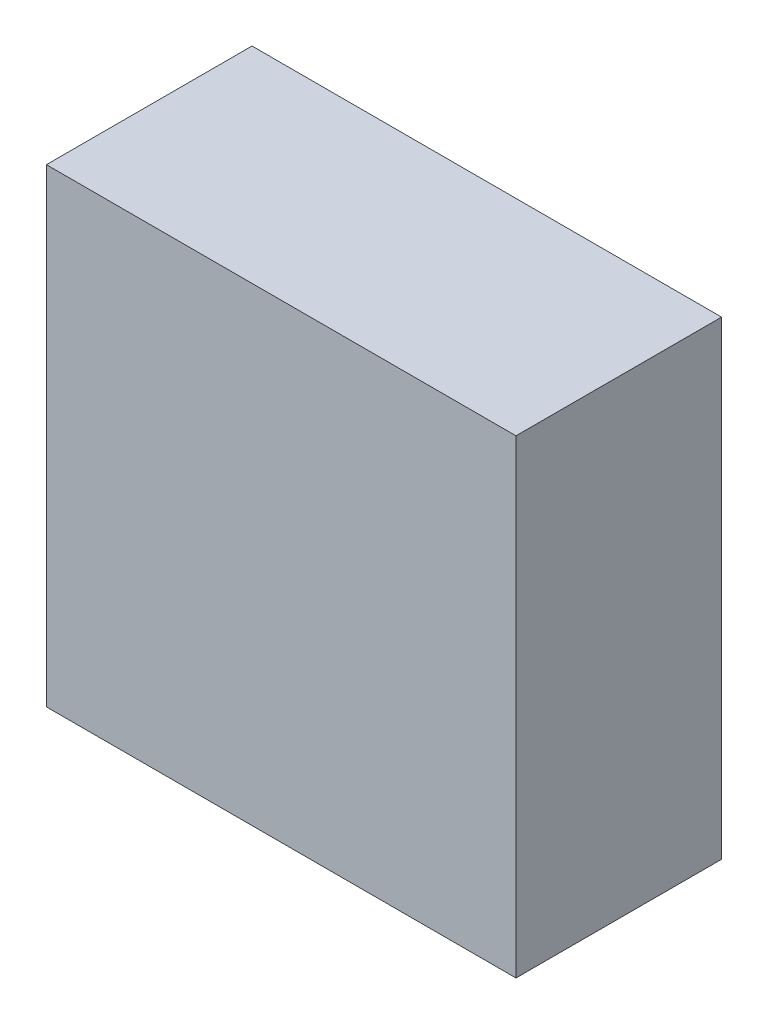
ISO-10303-21;
HEADER;
FILE_DESCRIPTION(('STEP AP214'),'2;1');
FILE_NAME('part.step','',(''),(''),'','','');
FILE_SCHEMA(('AUTOMOTIVE_DESIGN { 1 0 10303 214 1 1 1 1 }'));
ENDSEC;
DATA;
#1=APPLICATION_CONTEXT('core data for automotive mechanical design processes');
#2=APPLICATION_PROTOCOL_DEFINITION('international standard','automotive_design',2000,#1);
#3=PRODUCT_CONTEXT('',#1,'mechanical');
#4=PRODUCT('Part','Part','',(#3));
#5=PRODUCT_RELATED_PRODUCT_CATEGORY('part','',(#4));
#6=PRODUCT_DEFINITION_FORMATION('','',#4);
#7=PRODUCT_DEFINITION_CONTEXT('part definition',#1,'design');
#8=PRODUCT_DEFINITION('design','',#6,#7);
#9=PRODUCT_DEFINITION_SHAPE('','',#8);
#10=(LENGTH_UNIT() NAMED_UNIT(*) SI_UNIT(.MILLI.,.METRE.));
#11=(NAMED_UNIT(*) PLANE_ANGLE_UNIT() SI_UNIT($,.RADIAN.));
#12=(NAMED_UNIT(*) SI_UNIT($,.STERADIAN.) SOLID_ANGLE_UNIT());
#13=UNCERTAINTY_MEASURE_WITH_UNIT(LENGTH_MEASURE(1.E-05),#10,'distance_accuracy_value','');
#14=(GEOMETRIC_REPRESENTATION_CONTEXT(3) GLOBAL_UNCERTAINTY_ASSIGNED_CONTEXT((#13)) GLOBAL_UNIT_ASSIGNED_CONTEXT((#10,
#11,#12)) REPRESENTATION_CONTEXT('',''));
#15=CARTESIAN_POINT('',(0.,0.,0.));
#16=DIRECTION('',(0.,0.,1.));
#17=DIRECTION('',(1.,0.,0.));
#18=AXIS2_PLACEMENT_3D('',#15,#16,#17);
#19=CARTESIAN_POINT('',(0.,0.,13.9));
#20=DIRECTION('',(0.,0.,-1.));
#21=DIRECTION('',(-1.,0.,0.));
#22=AXIS2_PLACEMENT_3D('',#19,#20,#21);
#23=PLANE('',#22);
#24=DIRECTION('',(1.,0.,0.));
#25=VECTOR('',#24,1.);
#26=CARTESIAN_POINT('',(-15.875,15.875,13.9));
#27=LINE('',#26,#25);
#28=CARTESIAN_POINT('',(-15.875,15.875,13.9));
#29=VERTEX_POINT('',#28);
#30=CARTESIAN_POINT('',(15.875,15.875,13.9));
#31=VERTEX_POINT('',#30);
#32=EDGE_CURVE('E68',#29,#31,#27,.T.);
#33=ORIENTED_EDGE('',*,*,#32,.F.);
#34=DIRECTION('',(0.,1.,0.));
#35=VECTOR('',#34,1.);
#36=CARTESIAN_POINT('',(-15.875,-15.875,13.9));
#37=LINE('',#36,#35);
#38=CARTESIAN_POINT('',(-15.875,-15.875,13.9));
#39=VERTEX_POINT('',#38);
#40=EDGE_CURVE('E76',#39,#29,#37,.T.);
#41=ORIENTED_EDGE('',*,*,#40,.F.);
#42=DIRECTION('',(-1.,0.,0.));
#43=VECTOR('',#42,1.);
#44=CARTESIAN_POINT('',(15.875,-15.875,13.9));
#45=LINE('',#44,#43);
#46=CARTESIAN_POINT('',(15.875,-15.875,13.9));
#47=VERTEX_POINT('',#46);
#48=EDGE_CURVE('E70',#47,#39,#45,.T.);
#49=ORIENTED_EDGE('',*,*,#48,.F.);
#50=DIRECTION('',(0.,-1.,0.));
#51=VECTOR('',#50,1.);
#52=CARTESIAN_POINT('',(15.875,15.875,13.9));
#53=LINE('',#52,#51);
#54=EDGE_CURVE('E56',#31,#47,#53,.T.);
#55=ORIENTED_EDGE('',*,*,#54,.F.);
#56=EDGE_LOOP('',(#33,#41,#49,#55));
#57=FACE_BOUND('',#56,.T.);
#58=ADVANCED_FACE('F14',(#57),#23,.F.);
#59=CARTESIAN_POINT('',(-15.875,15.875,0.254));
#60=DIRECTION('',(0.,1.,0.));
#61=DIRECTION('',(-1.,0.,0.));
#62=AXIS2_PLACEMENT_3D('',#59,#60,#61);
#63=PLANE('',#62);
#64=DIRECTION('',(0.,0.,1.));
#65=VECTOR('',#64,1.);
#66=CARTESIAN_POINT('',(-15.875,15.875,0.254));
#67=LINE('',#66,#65);
#68=CARTESIAN_POINT('',(-15.875,15.875,0.));
#69=VERTEX_POINT('',#68);
#70=EDGE_CURVE('E62',#69,#29,#67,.T.);
#71=ORIENTED_EDGE('',*,*,#70,.T.);
#72=ORIENTED_EDGE('',*,*,#32,.T.);
#73=DIRECTION('',(0.,0.,1.));
#74=VECTOR('',#73,1.);
#75=CARTESIAN_POINT('',(15.875,15.875,0.254));
#76=LINE('',#75,#74);
#77=CARTESIAN_POINT('',(15.875,15.875,0.));
#78=VERTEX_POINT('',#77);
#79=EDGE_CURVE('E53',#78,#31,#76,.T.);
#80=ORIENTED_EDGE('',*,*,#79,.F.);
#81=DIRECTION('',(-1.,0.,0.));
#82=VECTOR('',#81,1.);
#83=CARTESIAN_POINT('',(-15.875,15.875,0.));
#84=LINE('',#83,#82);
#85=EDGE_CURVE('E81',#78,#69,#84,.T.);
#86=ORIENTED_EDGE('',*,*,#85,.T.);
#87=EDGE_LOOP('',(#71,#72,#80,#86));
#88=FACE_BOUND('',#87,.T.);
#89=ADVANCED_FACE('F72',(#88),#63,.T.);
#90=CARTESIAN_POINT('',(15.875,15.875,0.254));
#91=DIRECTION('',(1.,0.,0.));
#92=DIRECTION('',(0.,1.,0.));
#93=AXIS2_PLACEMENT_3D('',#90,#91,#92);
#94=PLANE('',#93);
#95=ORIENTED_EDGE('',*,*,#54,.T.);
#96=DIRECTION('',(0.,0.,1.));
#97=VECTOR('',#96,1.);
#98=CARTESIAN_POINT('',(15.875,-15.875,0.254));
#99=LINE('',#98,#97);
#100=CARTESIAN_POINT('',(15.875,-15.875,0.));
#101=VERTEX_POINT('',#100);
#102=EDGE_CURVE('E9',#101,#47,#99,.T.);
#103=ORIENTED_EDGE('',*,*,#102,.F.);
#104=DIRECTION('',(0.,1.,0.));
#105=VECTOR('',#104,1.);
#106=CARTESIAN_POINT('',(15.875,15.875,0.));
#107=LINE('',#106,#105);
#108=EDGE_CURVE('E57',#101,#78,#107,.T.);
#109=ORIENTED_EDGE('',*,*,#108,.T.);
#110=ORIENTED_EDGE('',*,*,#79,.T.);
#111=EDGE_LOOP('',(#95,#103,#109,#110));
#112=FACE_BOUND('',#111,.T.);
#113=ADVANCED_FACE('F55',(#112),#94,.T.);
#114=CARTESIAN_POINT('',(-15.875,15.875,0.254));
#115=DIRECTION('',(-1.,0.,0.));
#116=DIRECTION('',(0.,-1.,0.));
#117=AXIS2_PLACEMENT_3D('',#114,#115,#116);
#118=PLANE('',#117);
#119=ORIENTED_EDGE('',*,*,#40,.T.);
#120=ORIENTED_EDGE('',*,*,#70,.F.);
#121=DIRECTION('',(0.,-1.,0.));
#122=VECTOR('',#121,1.);
#123=CARTESIAN_POINT('',(-15.875,15.875,0.));
#124=LINE('',#123,#122);
#125=CARTESIAN_POINT('',(-15.875,-15.875,0.));
#126=VERTEX_POINT('',#125);
#127=EDGE_CURVE('E82',#69,#126,#124,.T.);
#128=ORIENTED_EDGE('',*,*,#127,.T.);
#129=DIRECTION('',(0.,0.,1.));
#130=VECTOR('',#129,1.);
#131=CARTESIAN_POINT('',(-15.875,-15.875,0.254));
#132=LINE('',#131,#130);
#133=EDGE_CURVE('E23',#126,#39,#132,.T.);
#134=ORIENTED_EDGE('',*,*,#133,.T.);
#135=EDGE_LOOP('',(#119,#120,#128,#134));
#136=FACE_BOUND('',#135,.T.);
#137=ADVANCED_FACE('F93',(#136),#118,.T.);
#138=CARTESIAN_POINT('',(-15.875,-15.875,0.254));
#139=DIRECTION('',(0.,-1.,0.));
#140=DIRECTION('',(1.,0.,0.));
#141=AXIS2_PLACEMENT_3D('',#138,#139,#140);
#142=PLANE('',#141);
#143=ORIENTED_EDGE('',*,*,#102,.T.);
#144=ORIENTED_EDGE('',*,*,#48,.T.);
#145=ORIENTED_EDGE('',*,*,#133,.F.);
#146=DIRECTION('',(1.,0.,0.));
#147=VECTOR('',#146,1.);
#148=CARTESIAN_POINT('',(-15.875,-15.875,0.));
#149=LINE('',#148,#147);
#150=EDGE_CURVE('E18',#126,#101,#149,.T.);
#151=ORIENTED_EDGE('',*,*,#150,.T.);
#152=EDGE_LOOP('',(#143,#144,#145,#151));
#153=FACE_BOUND('',#152,.T.);
#154=ADVANCED_FACE('F86',(#153),#142,.T.);
#155=CARTESIAN_POINT('',(0.,0.,0.));
#156=DIRECTION('',(0.,0.,1.));
#157=DIRECTION('',(0.,-1.,0.));
#158=AXIS2_PLACEMENT_3D('',#155,#156,#157);
#159=PLANE('',#158);
#160=ORIENTED_EDGE('',*,*,#108,.F.);
#161=ORIENTED_EDGE('',*,*,#150,.F.);
#162=ORIENTED_EDGE('',*,*,#127,.F.);
#163=ORIENTED_EDGE('',*,*,#85,.F.);
#164=EDGE_LOOP('',(#160,#161,#162,#163));
#165=FACE_BOUND('',#164,.T.);
#166=ADVANCED_FACE('F16',(#165),#159,.F.);
#167=CLOSED_SHELL('',(#58,#89,#113,#137,#154,#166));
#168=MANIFOLD_SOLID_BREP('B1',#167);
#169=ADVANCED_BREP_SHAPE_REPRESENTATION('',(#18,#168),#14);
#170=SHAPE_DEFINITION_REPRESENTATION(#9,#169);
ENDSEC;
END-ISO-10303-21;
